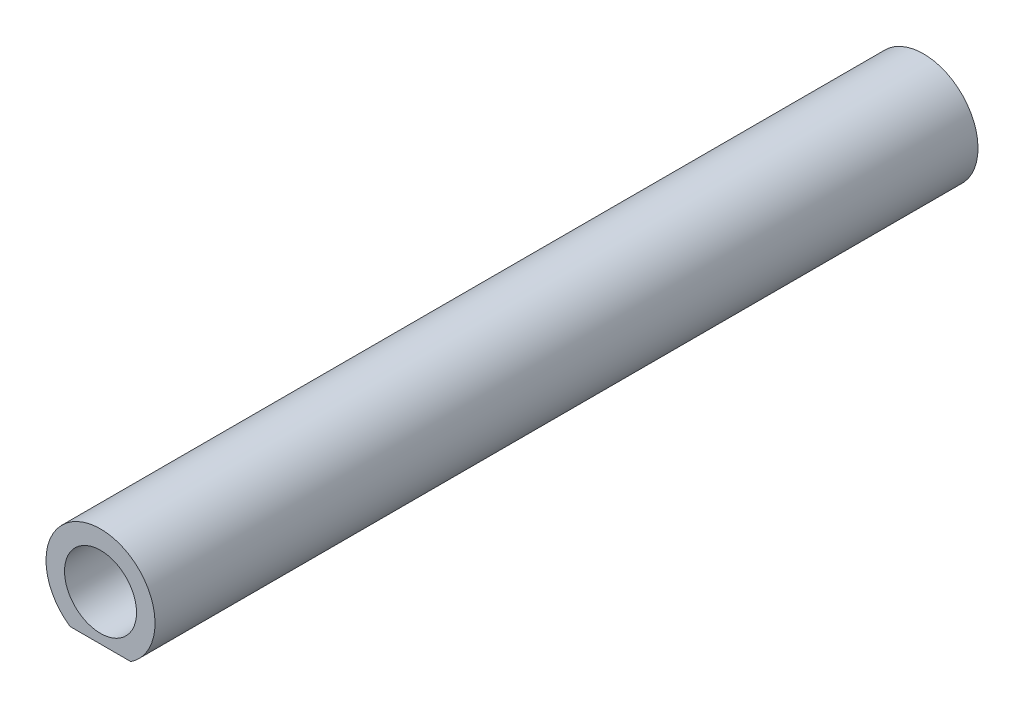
from build123d import *

# Parameters (mm, degrees)
SKETCH1_R           = 11.1125
BOSS_EXTRUDE1_DEPTH = 254


with BuildPart() as part:
    # Sketch1 → Boss-Extrude1 (new body)
    with BuildSketch(Plane.XY):
        with BuildLine():
            ThreePointArc((16.8275, 0), (-7.915344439, 14.849649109), (-9.381037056, -13.97))
            Line((-9.381037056, -13.97), (9.381037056, -13.97))
            ThreePointArc((9.381037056, -13.97), (14.849649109, -7.915344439), (16.8275, 0))
        make_face()
        Circle(SKETCH1_R, mode=Mode.SUBTRACT)
    extrude(amount=BOSS_EXTRUDE1_DEPTH)


solid = part.part
